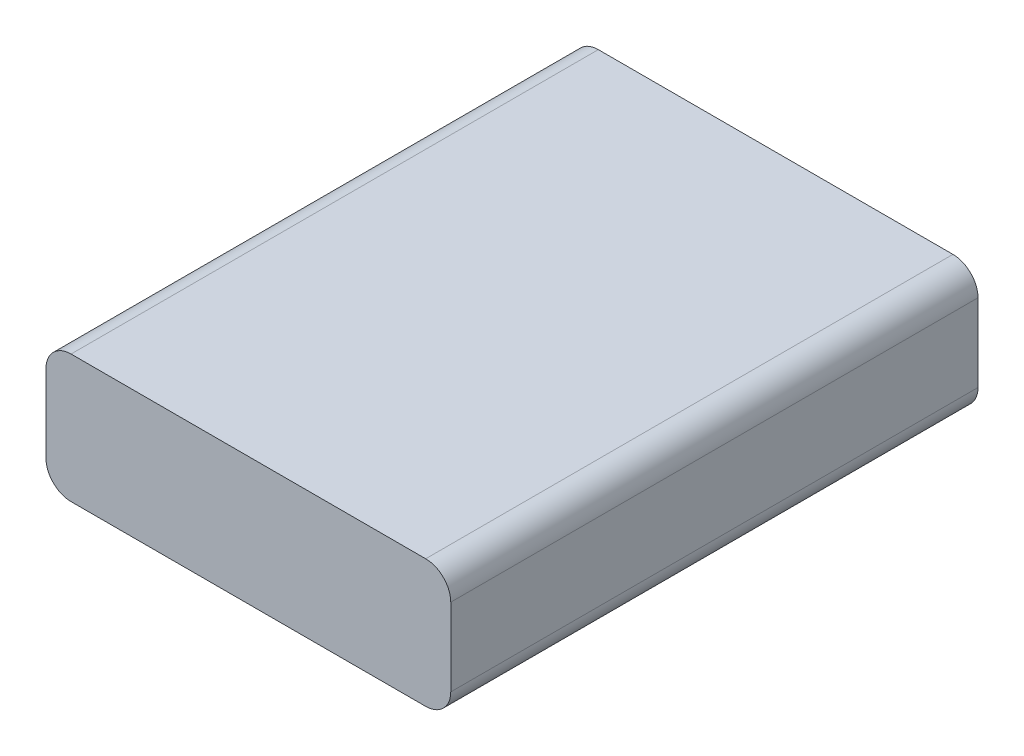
from build123d import *

# Parameters (mm, degrees)
ESQUISSE1_W        = 48.44
ESQUISSE1_H        = 63.1
BOSS_EXTRU_1_DEPTH = 15.3
ESQUISSE2_W        = 6
ESQUISSE2_H        = 3.1
BOSS_EXTRU_2_DEPTH = 1.9
CONG_1_R           = 3


with BuildPart() as part:
    # Esquisse1 → Boss.-Extru.1 (new body)
    with BuildSketch(Plane(origin=(0, 0, 0), x_dir=(1, 0, 0), z_dir=(0, 1, 0))):
        Rectangle(ESQUISSE1_W, ESQUISSE1_H)
    extrude(amount=BOSS_EXTRU_1_DEPTH)

    # Esquisse2 → Boss.-Extru.2 (add)
    with BuildSketch(Plane.XZ):
        with Locations((12.22, 25.7)):
            Rectangle(ESQUISSE2_W, ESQUISSE2_H)
    extrude(amount=BOSS_EXTRU_2_DEPTH)

    # Cong_1
    cong_1_edges = [part.edges().sort_by_distance(p)[0] for p in [
        (-24.22, 15.3, 0),
        (24.22, 15.3, 0),
        (-24.22, 0, 0),
        (24.22, 0, 0),
    ]]
    fillet(cong_1_edges, radius=CONG_1_R)


solid = part.part
